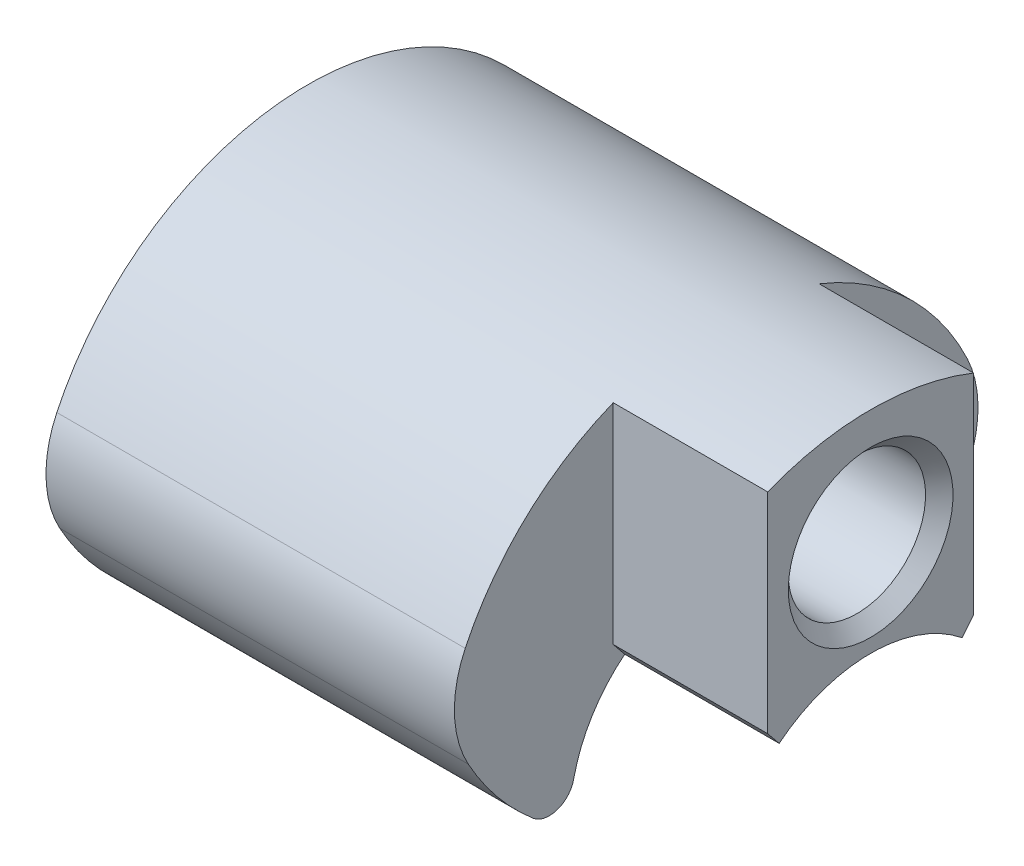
ISO-10303-21;
HEADER;
FILE_DESCRIPTION(('STEP AP214'),'2;1');
FILE_NAME('part.step','',(''),(''),'','','');
FILE_SCHEMA(('AUTOMOTIVE_DESIGN { 1 0 10303 214 1 1 1 1 }'));
ENDSEC;
DATA;
#1=APPLICATION_CONTEXT('core data for automotive mechanical design processes');
#2=APPLICATION_PROTOCOL_DEFINITION('international standard','automotive_design',2000,#1);
#3=PRODUCT_CONTEXT('',#1,'mechanical');
#4=PRODUCT('Part','Part','',(#3));
#5=PRODUCT_RELATED_PRODUCT_CATEGORY('part','',(#4));
#6=PRODUCT_DEFINITION_FORMATION('','',#4);
#7=PRODUCT_DEFINITION_CONTEXT('part definition',#1,'design');
#8=PRODUCT_DEFINITION('design','',#6,#7);
#9=PRODUCT_DEFINITION_SHAPE('','',#8);
#10=(LENGTH_UNIT() NAMED_UNIT(*) SI_UNIT(.MILLI.,.METRE.));
#11=(NAMED_UNIT(*) PLANE_ANGLE_UNIT() SI_UNIT($,.RADIAN.));
#12=(NAMED_UNIT(*) SI_UNIT($,.STERADIAN.) SOLID_ANGLE_UNIT());
#13=UNCERTAINTY_MEASURE_WITH_UNIT(LENGTH_MEASURE(1.E-05),#10,'distance_accuracy_value','');
#14=(GEOMETRIC_REPRESENTATION_CONTEXT(3) GLOBAL_UNCERTAINTY_ASSIGNED_CONTEXT((#13)) GLOBAL_UNIT_ASSIGNED_CONTEXT((#10,
#11,#12)) REPRESENTATION_CONTEXT('',''));
#15=CARTESIAN_POINT('',(0.,0.,0.));
#16=DIRECTION('',(0.,0.,1.));
#17=DIRECTION('',(1.,0.,0.));
#18=AXIS2_PLACEMENT_3D('',#15,#16,#17);
#19=CARTESIAN_POINT('',(32.8,4.1716666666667,8.75712265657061));
#20=DIRECTION('',(-1.,0.,0.));
#21=DIRECTION('',(0.,0.,1.));
#22=AXIS2_PLACEMENT_3D('',#19,#20,#21);
#23=CYLINDRICAL_SURFACE('',#22,6.5);
#24=CARTESIAN_POINT('',(23.8,4.17166666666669,8.75712265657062));
#25=DIRECTION('',(1.,0.,0.));
#26=DIRECTION('',(0.,0.,-1.));
#27=AXIS2_PLACEMENT_3D('',#24,#25,#26);
#28=CIRCLE('',#27,6.5);
#29=CARTESIAN_POINT('',(23.8,6.96711340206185,14.6252976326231));
#30=VERTEX_POINT('',#29);
#31=CARTESIAN_POINT('',(23.8,1.03325000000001,14.4492523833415));
#32=VERTEX_POINT('',#31);
#33=EDGE_CURVE('E599',#30,#32,#28,.T.);
#34=ORIENTED_EDGE('',*,*,#33,.F.);
#35=DIRECTION('',(-1.,0.,0.));
#36=VECTOR('',#35,1.);
#37=CARTESIAN_POINT('',(32.8,6.9671134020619,14.6252976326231));
#38=LINE('',#37,#36);
#39=CARTESIAN_POINT('',(0.,6.96711340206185,14.6252976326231));
#40=VERTEX_POINT('',#39);
#41=EDGE_CURVE('E492',#30,#40,#38,.T.);
#42=ORIENTED_EDGE('',*,*,#41,.T.);
#43=CARTESIAN_POINT('',(0.,4.17166666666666,8.75712265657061));
#44=DIRECTION('',(1.,0.,0.));
#45=DIRECTION('',(0.,0.,-1.));
#46=AXIS2_PLACEMENT_3D('',#43,#44,#45);
#47=CIRCLE('',#46,6.5);
#48=CARTESIAN_POINT('',(0.,1.03325,14.4492523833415));
#49=VERTEX_POINT('',#48);
#50=EDGE_CURVE('E578',#40,#49,#47,.T.);
#51=ORIENTED_EDGE('',*,*,#50,.T.);
#52=DIRECTION('',(-1.,0.,0.));
#53=VECTOR('',#52,1.);
#54=CARTESIAN_POINT('',(32.8,1.03325000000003,14.4492523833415));
#55=LINE('',#54,#53);
#56=EDGE_CURVE('E490',#32,#49,#55,.T.);
#57=ORIENTED_EDGE('',*,*,#56,.F.);
#58=EDGE_LOOP('',(#34,#42,#51,#57));
#59=FACE_BOUND('',#58,.T.);
#60=ADVANCED_FACE('F350',(#59),#23,.T.);
#61=CARTESIAN_POINT('',(32.8,9.00000000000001,0.));
#62=DIRECTION('',(-1.,0.,0.));
#63=DIRECTION('',(0.,0.,1.));
#64=AXIS2_PLACEMENT_3D('',#61,#62,#63);
#65=CYLINDRICAL_SURFACE('',#64,16.5);
#66=CARTESIAN_POINT('',(23.8,9.00000000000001,0.));
#67=DIRECTION('',(1.,0.,0.));
#68=DIRECTION('',(0.,0.,-1.));
#69=AXIS2_PLACEMENT_3D('',#66,#67,#68);
#70=CIRCLE('',#69,16.5);
#71=CARTESIAN_POINT('',(23.8,-3.59426910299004,10.6599430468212));
#72=VERTEX_POINT('',#71);
#73=EDGE_CURVE('E596',#32,#72,#70,.T.);
#74=ORIENTED_EDGE('',*,*,#73,.F.);
#75=ORIENTED_EDGE('',*,*,#56,.T.);
#76=CARTESIAN_POINT('',(0.,9.00000000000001,0.));
#77=DIRECTION('',(1.,0.,0.));
#78=DIRECTION('',(0.,0.,-1.));
#79=AXIS2_PLACEMENT_3D('',#76,#77,#78);
#80=CIRCLE('',#79,16.5);
#81=CARTESIAN_POINT('',(0.,-3.59426910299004,10.6599430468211));
#82=VERTEX_POINT('',#81);
#83=EDGE_CURVE('E581',#49,#82,#80,.T.);
#84=ORIENTED_EDGE('',*,*,#83,.T.);
#85=DIRECTION('',(-1.,0.,0.));
#86=VECTOR('',#85,1.);
#87=CARTESIAN_POINT('',(32.8,-3.59426910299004,10.6599430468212));
#88=LINE('',#87,#86);
#89=EDGE_CURVE('E488',#72,#82,#88,.T.);
#90=ORIENTED_EDGE('',*,*,#89,.F.);
#91=EDGE_LOOP('',(#74,#75,#84,#90));
#92=FACE_BOUND('',#91,.T.);
#93=ADVANCED_FACE('F594',(#92),#65,.T.);
#94=CARTESIAN_POINT('',(32.8,-2.48750000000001,9.72316017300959));
#95=DIRECTION('',(-1.,0.,0.));
#96=DIRECTION('',(0.,0.,1.));
#97=AXIS2_PLACEMENT_3D('',#94,#95,#96);
#98=CYLINDRICAL_SURFACE('',#97,1.45);
#99=CARTESIAN_POINT('',(23.8,-2.48750000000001,9.7231601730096));
#100=DIRECTION('',(1.,0.,0.));
#101=DIRECTION('',(0.,0.,-1.));
#102=AXIS2_PLACEMENT_3D('',#99,#100,#101);
#103=CIRCLE('',#102,1.45);
#104=CARTESIAN_POINT('',(23.8,-2.79535175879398,8.30621723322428));
#105=VERTEX_POINT('',#104);
#106=EDGE_CURVE('E624',#72,#105,#103,.T.);
#107=ORIENTED_EDGE('',*,*,#106,.F.);
#108=ORIENTED_EDGE('',*,*,#89,.T.);
#109=CARTESIAN_POINT('',(0.,-2.48750000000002,9.72316017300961));
#110=DIRECTION('',(1.,0.,0.));
#111=DIRECTION('',(0.,0.,-1.));
#112=AXIS2_PLACEMENT_3D('',#109,#110,#111);
#113=CIRCLE('',#112,1.45);
#114=CARTESIAN_POINT('',(0.,-2.79535175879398,8.30621723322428));
#115=VERTEX_POINT('',#114);
#116=EDGE_CURVE('E481',#82,#115,#113,.T.);
#117=ORIENTED_EDGE('',*,*,#116,.T.);
#118=DIRECTION('',(-1.,0.,0.));
#119=VECTOR('',#118,1.);
#120=CARTESIAN_POINT('',(32.8,-2.79535175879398,8.30621723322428));
#121=LINE('',#120,#119);
#122=EDGE_CURVE('E486',#105,#115,#121,.T.);
#123=ORIENTED_EDGE('',*,*,#122,.F.);
#124=EDGE_LOOP('',(#107,#108,#117,#123));
#125=FACE_BOUND('',#124,.T.);
#126=ADVANCED_FACE('F587',(#125),#98,.T.);
#127=CARTESIAN_POINT('',(32.8,-2.48750000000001,-9.7231601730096));
#128=DIRECTION('',(-1.,0.,0.));
#129=DIRECTION('',(0.,0.,1.));
#130=AXIS2_PLACEMENT_3D('',#127,#128,#129);
#131=CYLINDRICAL_SURFACE('',#130,1.45);
#132=CARTESIAN_POINT('',(23.8,-2.4875,-9.72316017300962));
#133=DIRECTION('',(1.,0.,0.));
#134=DIRECTION('',(0.,0.,-1.));
#135=AXIS2_PLACEMENT_3D('',#132,#133,#134);
#136=CIRCLE('',#135,1.45);
#137=CARTESIAN_POINT('',(23.8,-2.79535175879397,-8.30621723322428));
#138=VERTEX_POINT('',#137);
#139=CARTESIAN_POINT('',(23.8,-3.59426910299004,-10.6599430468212));
#140=VERTEX_POINT('',#139);
#141=EDGE_CURVE('E612',#138,#140,#136,.T.);
#142=ORIENTED_EDGE('',*,*,#141,.F.);
#143=DIRECTION('',(-1.,0.,0.));
#144=VECTOR('',#143,1.);
#145=CARTESIAN_POINT('',(32.8,-2.79535175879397,-8.30621723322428));
#146=LINE('',#145,#144);
#147=CARTESIAN_POINT('',(0.,-2.79535175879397,-8.30621723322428));
#148=VERTEX_POINT('',#147);
#149=EDGE_CURVE('E478',#138,#148,#146,.T.);
#150=ORIENTED_EDGE('',*,*,#149,.T.);
#151=CARTESIAN_POINT('',(0.,-2.4875,-9.72316017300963));
#152=DIRECTION('',(1.,0.,0.));
#153=DIRECTION('',(0.,0.,1.));
#154=AXIS2_PLACEMENT_3D('',#151,#152,#153);
#155=CIRCLE('',#154,1.45);
#156=CARTESIAN_POINT('',(0.,-3.59426910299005,-10.6599430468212));
#157=VERTEX_POINT('',#156);
#158=EDGE_CURVE('E558',#148,#157,#155,.T.);
#159=ORIENTED_EDGE('',*,*,#158,.T.);
#160=DIRECTION('',(-1.,0.,0.));
#161=VECTOR('',#160,1.);
#162=CARTESIAN_POINT('',(32.8,-3.59426910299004,-10.6599430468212));
#163=LINE('',#162,#161);
#164=EDGE_CURVE('E498',#140,#157,#163,.T.);
#165=ORIENTED_EDGE('',*,*,#164,.F.);
#166=EDGE_LOOP('',(#142,#150,#159,#165));
#167=FACE_BOUND('',#166,.T.);
#168=ADVANCED_FACE('F352',(#167),#131,.T.);
#169=CARTESIAN_POINT('',(32.8,9.00000000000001,0.));
#170=DIRECTION('',(-1.,0.,0.));
#171=DIRECTION('',(0.,0.,1.));
#172=AXIS2_PLACEMENT_3D('',#169,#170,#171);
#173=CYLINDRICAL_SURFACE('',#172,16.5);
#174=CARTESIAN_POINT('',(23.8,9.00000000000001,0.));
#175=DIRECTION('',(1.,0.,0.));
#176=DIRECTION('',(0.,0.,-1.));
#177=AXIS2_PLACEMENT_3D('',#174,#175,#176);
#178=CIRCLE('',#177,16.5);
#179=CARTESIAN_POINT('',(23.8,1.03325000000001,-14.4492523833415));
#180=VERTEX_POINT('',#179);
#181=EDGE_CURVE('E610',#140,#180,#178,.T.);
#182=ORIENTED_EDGE('',*,*,#181,.F.);
#183=ORIENTED_EDGE('',*,*,#164,.T.);
#184=CARTESIAN_POINT('',(0.,9.00000000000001,0.));
#185=DIRECTION('',(1.,0.,0.));
#186=DIRECTION('',(0.,0.,1.));
#187=AXIS2_PLACEMENT_3D('',#184,#185,#186);
#188=CIRCLE('',#187,16.5);
#189=CARTESIAN_POINT('',(0.,1.03325,-14.4492523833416));
#190=VERTEX_POINT('',#189);
#191=EDGE_CURVE('E562',#157,#190,#188,.T.);
#192=ORIENTED_EDGE('',*,*,#191,.T.);
#193=DIRECTION('',(-1.,0.,0.));
#194=VECTOR('',#193,1.);
#195=CARTESIAN_POINT('',(32.8,1.03325000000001,-14.4492523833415));
#196=LINE('',#195,#194);
#197=EDGE_CURVE('E496',#180,#190,#196,.T.);
#198=ORIENTED_EDGE('',*,*,#197,.F.);
#199=EDGE_LOOP('',(#182,#183,#192,#198));
#200=FACE_BOUND('',#199,.T.);
#201=ADVANCED_FACE('F609',(#200),#173,.T.);
#202=CARTESIAN_POINT('',(32.8,4.1716666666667,-8.75712265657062));
#203=DIRECTION('',(-1.,0.,0.));
#204=DIRECTION('',(0.,0.,1.));
#205=AXIS2_PLACEMENT_3D('',#202,#203,#204);
#206=CYLINDRICAL_SURFACE('',#205,6.5);
#207=CARTESIAN_POINT('',(23.8,4.17166666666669,-8.75712265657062));
#208=DIRECTION('',(1.,0.,0.));
#209=DIRECTION('',(0.,0.,-1.));
#210=AXIS2_PLACEMENT_3D('',#207,#208,#209);
#211=CIRCLE('',#210,6.5);
#212=CARTESIAN_POINT('',(23.8,6.96711340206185,-14.6252976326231));
#213=VERTEX_POINT('',#212);
#214=EDGE_CURVE('E606',#180,#213,#211,.T.);
#215=ORIENTED_EDGE('',*,*,#214,.F.);
#216=ORIENTED_EDGE('',*,*,#197,.T.);
#217=CARTESIAN_POINT('',(0.,4.17166666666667,-8.75712265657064));
#218=DIRECTION('',(1.,0.,0.));
#219=DIRECTION('',(0.,0.,1.));
#220=AXIS2_PLACEMENT_3D('',#217,#218,#219);
#221=CIRCLE('',#220,6.5);
#222=CARTESIAN_POINT('',(0.,6.96711340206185,-14.6252976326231));
#223=VERTEX_POINT('',#222);
#224=EDGE_CURVE('E567',#190,#223,#221,.T.);
#225=ORIENTED_EDGE('',*,*,#224,.T.);
#226=DIRECTION('',(-1.,0.,0.));
#227=VECTOR('',#226,1.);
#228=CARTESIAN_POINT('',(32.8,6.96711340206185,-14.6252976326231));
#229=LINE('',#228,#227);
#230=EDGE_CURVE('E494',#213,#223,#229,.T.);
#231=ORIENTED_EDGE('',*,*,#230,.F.);
#232=EDGE_LOOP('',(#215,#216,#225,#231));
#233=FACE_BOUND('',#232,.T.);
#234=ADVANCED_FACE('F604',(#233),#206,.T.);
#235=CARTESIAN_POINT('',(32.8,-3.54375000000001,-4.86158008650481));
#236=DIRECTION('',(-1.,0.,0.));
#237=DIRECTION('',(0.,0.,1.));
#238=AXIS2_PLACEMENT_3D('',#235,#236,#237);
#239=PLANE('',#238);
#240=CARTESIAN_POINT('',(32.8,9.50000000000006,0.));
#241=DIRECTION('',(-1.,0.,0.));
#242=DIRECTION('',(0.,0.,1.));
#243=AXIS2_PLACEMENT_3D('',#240,#241,#242);
#244=CIRCLE('',#243,4.80000000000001);
#245=CARTESIAN_POINT('',(32.8,9.50000000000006,4.80000000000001));
#246=VERTEX_POINT('',#245);
#247=EDGE_CURVE('E358',#246,#246,#244,.T.);
#248=ORIENTED_EDGE('',*,*,#247,.T.);
#249=EDGE_LOOP('',(#248));
#250=FACE_BOUND('',#249,.T.);
#251=DIRECTION('',(0.,1.,0.));
#252=VECTOR('',#251,1.);
#253=CARTESIAN_POINT('',(32.8,18.0755145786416,6.));
#254=LINE('',#253,#252);
#255=CARTESIAN_POINT('',(32.8,2.84562881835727,6.00000000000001));
#256=VERTEX_POINT('',#255);
#257=CARTESIAN_POINT('',(32.8,15.0479234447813,6.));
#258=VERTEX_POINT('',#257);
#259=EDGE_CURVE('E453',#256,#258,#254,.T.);
#260=ORIENTED_EDGE('',*,*,#259,.F.);
#261=DIRECTION('',(0.,0.777582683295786,0.628780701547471));
#262=VECTOR('',#261,1.);
#263=CARTESIAN_POINT('',(32.8,2.01960924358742,5.33205152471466));
#264=LINE('',#263,#262);
#265=CARTESIAN_POINT('',(32.8,2.01960924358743,5.33205152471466));
#266=VERTEX_POINT('',#265);
#267=EDGE_CURVE('E512',#256,#266,#264,.F.);
#268=ORIENTED_EDGE('',*,*,#267,.T.);
#269=CARTESIAN_POINT('',(32.8,-4.6,0.));
#270=DIRECTION('',(-1.,0.,0.));
#271=DIRECTION('',(0.,0.,-1.));
#272=AXIS2_PLACEMENT_3D('',#269,#270,#271);
#273=CIRCLE('',#272,8.5);
#274=CARTESIAN_POINT('',(32.8,2.01960924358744,-5.33205152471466));
#275=VERTEX_POINT('',#274);
#276=EDGE_CURVE('E475',#266,#275,#273,.T.);
#277=ORIENTED_EDGE('',*,*,#276,.T.);
#278=DIRECTION('',(0.,0.777582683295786,-0.628780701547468));
#279=VECTOR('',#278,1.);
#280=CARTESIAN_POINT('',(32.8,2.01960924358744,-5.33205152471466));
#281=LINE('',#280,#279);
#282=CARTESIAN_POINT('',(32.8,2.84562881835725,-6.00000000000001));
#283=VERTEX_POINT('',#282);
#284=EDGE_CURVE('E373',#275,#283,#281,.T.);
#285=ORIENTED_EDGE('',*,*,#284,.T.);
#286=DIRECTION('',(0.,-1.,0.));
#287=VECTOR('',#286,1.);
#288=CARTESIAN_POINT('',(32.8,18.0755145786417,-6.00000000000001));
#289=LINE('',#288,#287);
#290=CARTESIAN_POINT('',(32.8,15.0479234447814,-6.));
#291=VERTEX_POINT('',#290);
#292=EDGE_CURVE('E472',#291,#283,#289,.T.);
#293=ORIENTED_EDGE('',*,*,#292,.F.);
#294=CARTESIAN_POINT('',(32.8,0.,0.));
#295=DIRECTION('',(1.,0.,0.));
#296=DIRECTION('',(0.,0.,-1.));
#297=AXIS2_PLACEMENT_3D('',#294,#295,#296);
#298=CIRCLE('',#297,16.2);
#299=EDGE_CURVE('E469',#291,#258,#298,.T.);
#300=ORIENTED_EDGE('',*,*,#299,.T.);
#301=EDGE_LOOP('',(#260,#268,#277,#285,#293,#300));
#302=FACE_BOUND('',#301,.T.);
#303=ADVANCED_FACE('F474',(#250,#302),#239,.F.);
#304=CARTESIAN_POINT('',(0.,-3.54375000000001,-4.86158008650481));
#305=DIRECTION('',(-1.,0.,0.));
#306=DIRECTION('',(0.,0.,1.));
#307=AXIS2_PLACEMENT_3D('',#304,#305,#306);
#308=PLANE('',#307);
#309=CARTESIAN_POINT('',(0.,9.50000000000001,0.));
#310=DIRECTION('',(-1.,0.,0.));
#311=DIRECTION('',(0.,0.,1.));
#312=AXIS2_PLACEMENT_3D('',#309,#310,#311);
#313=CIRCLE('',#312,4.80000000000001);
#314=CARTESIAN_POINT('',(0.,9.50000000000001,4.80000000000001));
#315=VERTEX_POINT('',#314);
#316=EDGE_CURVE('E11',#315,#315,#313,.F.);
#317=ORIENTED_EDGE('',*,*,#316,.T.);
#318=EDGE_LOOP('',(#317));
#319=FACE_BOUND('',#318,.T.);
#320=ORIENTED_EDGE('',*,*,#158,.F.);
#321=CARTESIAN_POINT('',(0.,-4.6,0.));
#322=DIRECTION('',(-1.,0.,0.));
#323=DIRECTION('',(0.,0.,-1.));
#324=AXIS2_PLACEMENT_3D('',#321,#322,#323);
#325=CIRCLE('',#324,8.5);
#326=EDGE_CURVE('E476',#115,#148,#325,.T.);
#327=ORIENTED_EDGE('',*,*,#326,.F.);
#328=ORIENTED_EDGE('',*,*,#116,.F.);
#329=ORIENTED_EDGE('',*,*,#83,.F.);
#330=ORIENTED_EDGE('',*,*,#50,.F.);
#331=CARTESIAN_POINT('',(0.,0.,0.));
#332=DIRECTION('',(1.,0.,0.));
#333=DIRECTION('',(0.,0.,-1.));
#334=AXIS2_PLACEMENT_3D('',#331,#332,#333);
#335=CIRCLE('',#334,16.2);
#336=EDGE_CURVE('E575',#223,#40,#335,.T.);
#337=ORIENTED_EDGE('',*,*,#336,.F.);
#338=ORIENTED_EDGE('',*,*,#224,.F.);
#339=ORIENTED_EDGE('',*,*,#191,.F.);
#340=EDGE_LOOP('',(#320,#327,#328,#329,#330,#337,#338,#339));
#341=FACE_BOUND('',#340,.T.);
#342=ADVANCED_FACE('F550',(#319,#341),#308,.T.);
#343=CARTESIAN_POINT('',(32.8,0.,0.));
#344=DIRECTION('',(-1.,0.,0.));
#345=DIRECTION('',(0.,0.,1.));
#346=AXIS2_PLACEMENT_3D('',#343,#344,#345);
#347=CYLINDRICAL_SURFACE('',#346,16.2);
#348=CARTESIAN_POINT('',(23.8,0.,0.));
#349=DIRECTION('',(1.,0.,0.));
#350=DIRECTION('',(0.,0.,-1.));
#351=AXIS2_PLACEMENT_3D('',#348,#349,#350);
#352=CIRCLE('',#351,16.2);
#353=CARTESIAN_POINT('',(23.8,15.0479234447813,6.));
#354=VERTEX_POINT('',#353);
#355=EDGE_CURVE('E471',#354,#30,#352,.T.);
#356=ORIENTED_EDGE('',*,*,#355,.F.);
#357=DIRECTION('',(-1.,0.,0.));
#358=VECTOR('',#357,1.);
#359=CARTESIAN_POINT('',(32.8,15.0479234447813,6.));
#360=LINE('',#359,#358);
#361=EDGE_CURVE('E457',#354,#258,#360,.F.);
#362=ORIENTED_EDGE('',*,*,#361,.T.);
#363=ORIENTED_EDGE('',*,*,#299,.F.);
#364=DIRECTION('',(-1.,0.,0.));
#365=VECTOR('',#364,1.);
#366=CARTESIAN_POINT('',(32.8,15.0479234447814,-6.));
#367=LINE('',#366,#365);
#368=CARTESIAN_POINT('',(23.8,15.0479234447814,-6.));
#369=VERTEX_POINT('',#368);
#370=EDGE_CURVE('E565',#291,#369,#367,.T.);
#371=ORIENTED_EDGE('',*,*,#370,.T.);
#372=CARTESIAN_POINT('',(23.8,0.,0.));
#373=DIRECTION('',(1.,0.,0.));
#374=DIRECTION('',(0.,0.,-1.));
#375=AXIS2_PLACEMENT_3D('',#372,#373,#374);
#376=CIRCLE('',#375,16.2);
#377=EDGE_CURVE('E569',#213,#369,#376,.T.);
#378=ORIENTED_EDGE('',*,*,#377,.F.);
#379=ORIENTED_EDGE('',*,*,#230,.T.);
#380=ORIENTED_EDGE('',*,*,#336,.T.);
#381=ORIENTED_EDGE('',*,*,#41,.F.);
#382=EDGE_LOOP('',(#356,#362,#363,#371,#378,#379,#380,#381));
#383=FACE_BOUND('',#382,.T.);
#384=ADVANCED_FACE('F467',(#383),#347,.T.);
#385=CARTESIAN_POINT('',(32.8,-4.6,0.));
#386=DIRECTION('',(-1.,0.,0.));
#387=DIRECTION('',(0.,0.,1.));
#388=AXIS2_PLACEMENT_3D('',#385,#386,#387);
#389=CYLINDRICAL_SURFACE('',#388,8.5);
#390=ORIENTED_EDGE('',*,*,#276,.F.);
#391=DIRECTION('',(-1.,0.,0.));
#392=VECTOR('',#391,1.);
#393=CARTESIAN_POINT('',(32.8,2.01960924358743,5.33205152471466));
#394=LINE('',#393,#392);
#395=CARTESIAN_POINT('',(23.8,2.01960924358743,5.33205152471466));
#396=VERTEX_POINT('',#395);
#397=EDGE_CURVE('E507',#266,#396,#394,.T.);
#398=ORIENTED_EDGE('',*,*,#397,.T.);
#399=CARTESIAN_POINT('',(23.8,-4.6,0.));
#400=DIRECTION('',(1.,0.,0.));
#401=DIRECTION('',(0.,0.,-1.));
#402=AXIS2_PLACEMENT_3D('',#399,#400,#401);
#403=CIRCLE('',#402,8.5);
#404=EDGE_CURVE('E502',#105,#396,#403,.F.);
#405=ORIENTED_EDGE('',*,*,#404,.F.);
#406=ORIENTED_EDGE('',*,*,#122,.T.);
#407=ORIENTED_EDGE('',*,*,#326,.T.);
#408=ORIENTED_EDGE('',*,*,#149,.F.);
#409=CARTESIAN_POINT('',(23.8,-4.6,0.));
#410=DIRECTION('',(1.,0.,0.));
#411=DIRECTION('',(0.,0.,-1.));
#412=AXIS2_PLACEMENT_3D('',#409,#410,#411);
#413=CIRCLE('',#412,8.5);
#414=CARTESIAN_POINT('',(23.8,2.01960924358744,-5.33205152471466));
#415=VERTEX_POINT('',#414);
#416=EDGE_CURVE('E500',#415,#138,#413,.F.);
#417=ORIENTED_EDGE('',*,*,#416,.F.);
#418=DIRECTION('',(-1.,0.,0.));
#419=VECTOR('',#418,1.);
#420=CARTESIAN_POINT('',(32.8,2.01960924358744,-5.33205152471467));
#421=LINE('',#420,#419);
#422=EDGE_CURVE('E504',#415,#275,#421,.F.);
#423=ORIENTED_EDGE('',*,*,#422,.T.);
#424=EDGE_LOOP('',(#390,#398,#405,#406,#407,#408,#417,#423));
#425=FACE_BOUND('',#424,.T.);
#426=ADVANCED_FACE('F541',(#425),#389,.F.);
#427=CARTESIAN_POINT('',(32.8,9.50000000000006,0.));
#428=DIRECTION('',(-1.,0.,0.));
#429=DIRECTION('',(0.,0.,1.));
#430=AXIS2_PLACEMENT_3D('',#427,#428,#429);
#431=CYLINDRICAL_SURFACE('',#430,4.);
#432=CARTESIAN_POINT('',(32.,9.50000000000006,0.));
#433=DIRECTION('',(-1.,0.,0.));
#434=DIRECTION('',(0.,0.,1.));
#435=AXIS2_PLACEMENT_3D('',#432,#433,#434);
#436=CIRCLE('',#435,4.);
#437=CARTESIAN_POINT('',(32.,9.50000000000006,4.));
#438=VERTEX_POINT('',#437);
#439=EDGE_CURVE('E523',#438,#438,#436,.F.);
#440=ORIENTED_EDGE('',*,*,#439,.T.);
#441=EDGE_LOOP('',(#440));
#442=FACE_BOUND('',#441,.T.);
#443=CARTESIAN_POINT('',(0.800000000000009,9.50000000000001,0.));
#444=DIRECTION('',(-1.,0.,0.));
#445=DIRECTION('',(0.,0.,1.));
#446=AXIS2_PLACEMENT_3D('',#443,#444,#445);
#447=CIRCLE('',#446,4.);
#448=CARTESIAN_POINT('',(0.800000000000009,9.50000000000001,3.99999999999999));
#449=VERTEX_POINT('',#448);
#450=EDGE_CURVE('E520',#449,#449,#447,.T.);
#451=ORIENTED_EDGE('',*,*,#450,.T.);
#452=EDGE_LOOP('',(#451));
#453=FACE_BOUND('',#452,.T.);
#454=ADVANCED_FACE('F537',(#442,#453),#431,.F.);
#455=CARTESIAN_POINT('',(23.8,18.0755145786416,-6.));
#456=DIRECTION('',(0.,0.,1.));
#457=DIRECTION('',(0.,-1.,0.));
#458=AXIS2_PLACEMENT_3D('',#455,#456,#457);
#459=PLANE('',#458);
#460=ORIENTED_EDGE('',*,*,#292,.T.);
#461=DIRECTION('',(-1.,0.,0.));
#462=VECTOR('',#461,1.);
#463=CARTESIAN_POINT('',(23.8,2.84562881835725,-6.00000000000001));
#464=LINE('',#463,#462);
#465=CARTESIAN_POINT('',(23.8,2.84562881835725,-6.00000000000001));
#466=VERTEX_POINT('',#465);
#467=EDGE_CURVE('E365',#283,#466,#464,.T.);
#468=ORIENTED_EDGE('',*,*,#467,.T.);
#469=DIRECTION('',(0.,-1.,0.));
#470=VECTOR('',#469,1.);
#471=CARTESIAN_POINT('',(23.8,18.0755145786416,-6.));
#472=LINE('',#471,#470);
#473=EDGE_CURVE('E615',#369,#466,#472,.T.);
#474=ORIENTED_EDGE('',*,*,#473,.F.);
#475=ORIENTED_EDGE('',*,*,#370,.F.);
#476=EDGE_LOOP('',(#460,#468,#474,#475));
#477=FACE_BOUND('',#476,.T.);
#478=ADVANCED_FACE('F540',(#477),#459,.F.);
#479=CARTESIAN_POINT('',(23.8,18.0755145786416,-16.4020283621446));
#480=DIRECTION('',(1.,0.,0.));
#481=DIRECTION('',(0.,0.,-1.));
#482=AXIS2_PLACEMENT_3D('',#479,#480,#481);
#483=PLANE('',#482);
#484=ORIENTED_EDGE('',*,*,#377,.T.);
#485=ORIENTED_EDGE('',*,*,#473,.T.);
#486=DIRECTION('',(0.,-0.777582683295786,0.628780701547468));
#487=VECTOR('',#486,1.);
#488=CARTESIAN_POINT('',(23.8,2.01960924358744,-5.33205152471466));
#489=LINE('',#488,#487);
#490=EDGE_CURVE('E517',#466,#415,#489,.T.);
#491=ORIENTED_EDGE('',*,*,#490,.T.);
#492=ORIENTED_EDGE('',*,*,#416,.T.);
#493=ORIENTED_EDGE('',*,*,#141,.T.);
#494=ORIENTED_EDGE('',*,*,#181,.T.);
#495=ORIENTED_EDGE('',*,*,#214,.T.);
#496=EDGE_LOOP('',(#484,#485,#491,#492,#493,#494,#495));
#497=FACE_BOUND('',#496,.T.);
#498=ADVANCED_FACE('F630',(#497),#483,.T.);
#499=CARTESIAN_POINT('',(23.8,18.0755145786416,6.));
#500=DIRECTION('',(0.,0.,-1.));
#501=DIRECTION('',(-1.,0.,0.));
#502=AXIS2_PLACEMENT_3D('',#499,#500,#501);
#503=PLANE('',#502);
#504=DIRECTION('',(0.,1.,0.));
#505=VECTOR('',#504,1.);
#506=CARTESIAN_POINT('',(23.8,18.0755145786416,6.));
#507=LINE('',#506,#505);
#508=CARTESIAN_POINT('',(23.8,2.84562881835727,6.));
#509=VERTEX_POINT('',#508);
#510=EDGE_CURVE('E463',#509,#354,#507,.T.);
#511=ORIENTED_EDGE('',*,*,#510,.F.);
#512=DIRECTION('',(1.,0.,0.));
#513=VECTOR('',#512,1.);
#514=CARTESIAN_POINT('',(23.8,2.84562881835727,6.));
#515=LINE('',#514,#513);
#516=EDGE_CURVE('E460',#509,#256,#515,.T.);
#517=ORIENTED_EDGE('',*,*,#516,.T.);
#518=ORIENTED_EDGE('',*,*,#259,.T.);
#519=ORIENTED_EDGE('',*,*,#361,.F.);
#520=EDGE_LOOP('',(#511,#517,#518,#519));
#521=FACE_BOUND('',#520,.T.);
#522=ADVANCED_FACE('F456',(#521),#503,.F.);
#523=CARTESIAN_POINT('',(23.8,18.0755145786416,6.));
#524=DIRECTION('',(1.,0.,0.));
#525=DIRECTION('',(0.,0.,-1.));
#526=AXIS2_PLACEMENT_3D('',#523,#524,#525);
#527=PLANE('',#526);
#528=ORIENTED_EDGE('',*,*,#355,.T.);
#529=ORIENTED_EDGE('',*,*,#33,.T.);
#530=ORIENTED_EDGE('',*,*,#73,.T.);
#531=ORIENTED_EDGE('',*,*,#106,.T.);
#532=ORIENTED_EDGE('',*,*,#404,.T.);
#533=DIRECTION('',(0.,-0.777582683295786,-0.628780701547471));
#534=VECTOR('',#533,1.);
#535=CARTESIAN_POINT('',(23.8,2.01960924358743,5.33205152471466));
#536=LINE('',#535,#534);
#537=EDGE_CURVE('E515',#396,#509,#536,.F.);
#538=ORIENTED_EDGE('',*,*,#537,.T.);
#539=ORIENTED_EDGE('',*,*,#510,.T.);
#540=EDGE_LOOP('',(#528,#529,#530,#531,#532,#538,#539));
#541=FACE_BOUND('',#540,.T.);
#542=ADVANCED_FACE('F623',(#541),#527,.T.);
#543=CARTESIAN_POINT('',(32.8,2.01960924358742,5.33205152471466));
#544=DIRECTION('',(0.,0.628780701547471,-0.777582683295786));
#545=DIRECTION('',(0.,0.777582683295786,0.628780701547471));
#546=AXIS2_PLACEMENT_3D('',#543,#544,#545);
#547=PLANE('',#546);
#548=ORIENTED_EDGE('',*,*,#267,.F.);
#549=ORIENTED_EDGE('',*,*,#516,.F.);
#550=ORIENTED_EDGE('',*,*,#537,.F.);
#551=ORIENTED_EDGE('',*,*,#397,.F.);
#552=EDGE_LOOP('',(#548,#549,#550,#551));
#553=FACE_BOUND('',#552,.T.);
#554=ADVANCED_FACE('F626',(#553),#547,.F.);
#555=CARTESIAN_POINT('',(32.8,2.01960924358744,-5.33205152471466));
#556=DIRECTION('',(0.,-0.628780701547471,-0.777582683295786));
#557=DIRECTION('',(0.,0.777582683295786,-0.628780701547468));
#558=AXIS2_PLACEMENT_3D('',#555,#556,#557);
#559=PLANE('',#558);
#560=ORIENTED_EDGE('',*,*,#490,.F.);
#561=ORIENTED_EDGE('',*,*,#467,.F.);
#562=ORIENTED_EDGE('',*,*,#284,.F.);
#563=ORIENTED_EDGE('',*,*,#422,.F.);
#564=EDGE_LOOP('',(#560,#561,#562,#563));
#565=FACE_BOUND('',#564,.T.);
#566=ADVANCED_FACE('F533',(#565),#559,.T.);
#567=CARTESIAN_POINT('',(32.,9.50000000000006,0.));
#568=DIRECTION('',(1.,0.,0.));
#569=DIRECTION('',(0.,0.,-1.));
#570=AXIS2_PLACEMENT_3D('',#567,#568,#569);
#571=CONICAL_SURFACE('',#570,4.,0.785398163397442);
#572=ORIENTED_EDGE('',*,*,#247,.F.);
#573=EDGE_LOOP('',(#572));
#574=FACE_BOUND('',#573,.T.);
#575=ORIENTED_EDGE('',*,*,#439,.F.);
#576=EDGE_LOOP('',(#575));
#577=FACE_BOUND('',#576,.T.);
#578=ADVANCED_FACE('F529',(#574,#577),#571,.F.);
#579=CARTESIAN_POINT('',(0.,9.50000000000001,0.));
#580=DIRECTION('',(-1.,0.,0.));
#581=DIRECTION('',(0.,0.,1.));
#582=AXIS2_PLACEMENT_3D('',#579,#580,#581);
#583=CONICAL_SURFACE('',#582,4.80000000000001,0.785398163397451);
#584=ORIENTED_EDGE('',*,*,#450,.F.);
#585=EDGE_LOOP('',(#584));
#586=FACE_BOUND('',#585,.T.);
#587=ORIENTED_EDGE('',*,*,#316,.F.);
#588=EDGE_LOOP('',(#587));
#589=FACE_BOUND('',#588,.T.);
#590=ADVANCED_FACE('F532',(#586,#589),#583,.F.);
#591=CLOSED_SHELL('',(#60,#93,#126,#168,#201,#234,#303,#342,#384,#426,#454,#478,#498,#522,#542,
#554,#566,#578,#590));
#592=MANIFOLD_SOLID_BREP('B2',#591);
#593=ADVANCED_BREP_SHAPE_REPRESENTATION('',(#18,#592),#14);
#594=SHAPE_DEFINITION_REPRESENTATION(#9,#593);
ENDSEC;
END-ISO-10303-21;
